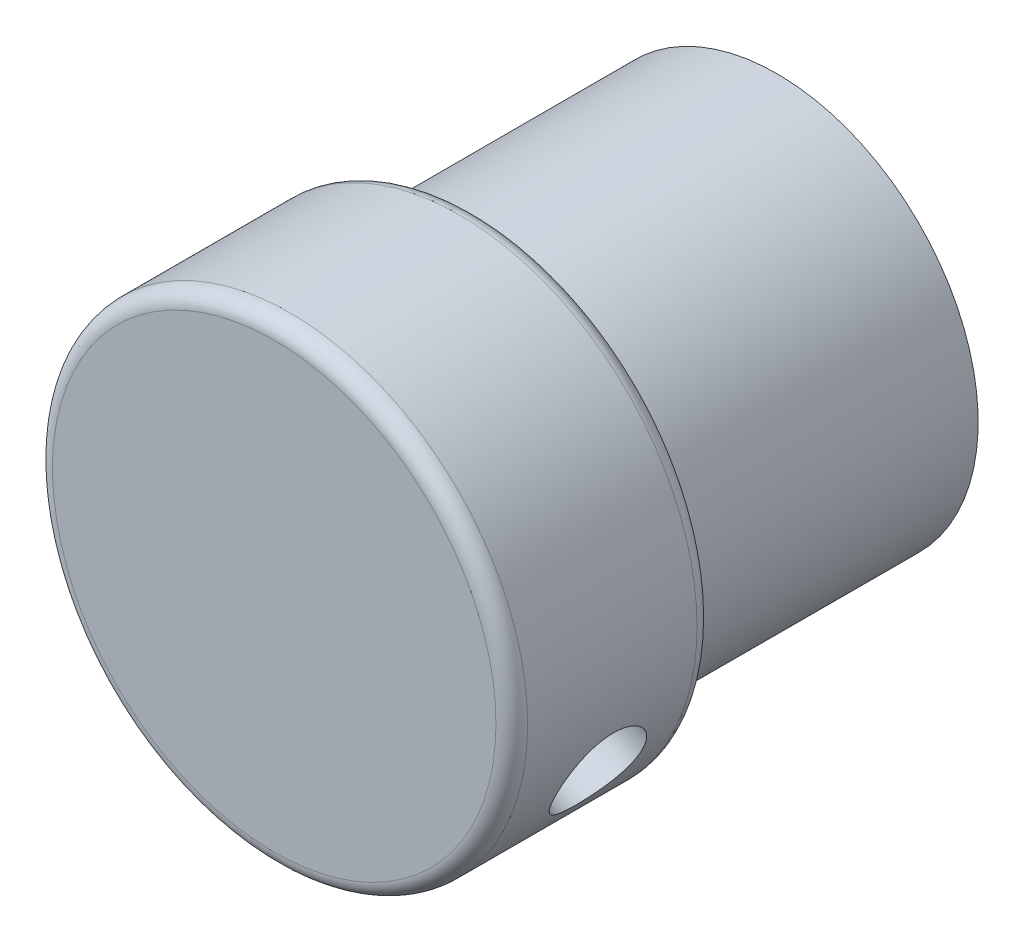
ISO-10303-21;
HEADER;
FILE_DESCRIPTION(('STEP AP214'),'2;1');
FILE_NAME('part.step','',(''),(''),'','','');
FILE_SCHEMA(('AUTOMOTIVE_DESIGN { 1 0 10303 214 1 1 1 1 }'));
ENDSEC;
DATA;
#1=APPLICATION_CONTEXT('core data for automotive mechanical design processes');
#2=APPLICATION_PROTOCOL_DEFINITION('international standard','automotive_design',2000,#1);
#3=PRODUCT_CONTEXT('',#1,'mechanical');
#4=PRODUCT('Part','Part','',(#3));
#5=PRODUCT_RELATED_PRODUCT_CATEGORY('part','',(#4));
#6=PRODUCT_DEFINITION_FORMATION('','',#4);
#7=PRODUCT_DEFINITION_CONTEXT('part definition',#1,'design');
#8=PRODUCT_DEFINITION('design','',#6,#7);
#9=PRODUCT_DEFINITION_SHAPE('','',#8);
#10=(LENGTH_UNIT() NAMED_UNIT(*) SI_UNIT(.MILLI.,.METRE.));
#11=(NAMED_UNIT(*) PLANE_ANGLE_UNIT() SI_UNIT($,.RADIAN.));
#12=(NAMED_UNIT(*) SI_UNIT($,.STERADIAN.) SOLID_ANGLE_UNIT());
#13=UNCERTAINTY_MEASURE_WITH_UNIT(LENGTH_MEASURE(1.E-05),#10,'distance_accuracy_value','');
#14=(GEOMETRIC_REPRESENTATION_CONTEXT(3) GLOBAL_UNCERTAINTY_ASSIGNED_CONTEXT((#13)) GLOBAL_UNIT_ASSIGNED_CONTEXT((#10,
#11,#12)) REPRESENTATION_CONTEXT('',''));
#15=CARTESIAN_POINT('',(0.,0.,0.));
#16=DIRECTION('',(0.,0.,1.));
#17=DIRECTION('',(1.,0.,0.));
#18=AXIS2_PLACEMENT_3D('',#15,#16,#17);
#19=CARTESIAN_POINT('',(102.391841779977,82.5092726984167,19.05));
#20=DIRECTION('',(0.,0.,-1.));
#21=DIRECTION('',(-1.,0.,0.));
#22=AXIS2_PLACEMENT_3D('',#19,#20,#21);
#23=CYLINDRICAL_SURFACE('',#22,12.7);
#24=CARTESIAN_POINT('',(102.391841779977,82.5092726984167,18.05));
#25=DIRECTION('',(0.,0.,1.));
#26=DIRECTION('',(1.,0.,0.));
#27=AXIS2_PLACEMENT_3D('',#24,#25,#26);
#28=CIRCLE('',#27,12.7);
#29=CARTESIAN_POINT('',(89.6918417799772,82.5092726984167,18.05));
#30=VERTEX_POINT('',#29);
#31=EDGE_CURVE('E41',#30,#30,#28,.F.);
#32=CARTESIAN_POINT('',(102.391841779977,82.5092726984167,0.));
#33=DIRECTION('',(0.,0.,1.));
#34=DIRECTION('',(1.,0.,0.));
#35=AXIS2_PLACEMENT_3D('',#32,#33,#34);
#36=CIRCLE('',#35,12.7);
#37=CARTESIAN_POINT('',(89.6918417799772,82.5092726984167,0.));
#38=VERTEX_POINT('',#37);
#39=EDGE_CURVE('E57',#38,#38,#36,.T.);
#40=CARTESIAN_POINT('',(89.6918417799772,82.5092726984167,18.05));
#41=CARTESIAN_POINT('',(89.6918417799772,82.5092726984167,17.8619791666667));
#42=CARTESIAN_POINT('',(89.6918417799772,82.5092726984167,17.6739583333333));
#43=CARTESIAN_POINT('',(89.6918417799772,82.5092726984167,17.2979166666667));
#44=CARTESIAN_POINT('',(89.6918417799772,82.5092726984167,17.1098958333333));
#45=CARTESIAN_POINT('',(89.6918417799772,82.5092726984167,16.7338541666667));
#46=CARTESIAN_POINT('',(89.6918417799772,82.5092726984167,16.5458333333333));
#47=CARTESIAN_POINT('',(89.6918417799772,82.5092726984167,16.1697916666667));
#48=CARTESIAN_POINT('',(89.6918417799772,82.5092726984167,15.9817708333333));
#49=CARTESIAN_POINT('',(89.6918417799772,82.5092726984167,15.6057291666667));
#50=CARTESIAN_POINT('',(89.6918417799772,82.5092726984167,15.4177083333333));
#51=CARTESIAN_POINT('',(89.6918417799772,82.5092726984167,15.0416666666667));
#52=CARTESIAN_POINT('',(89.6918417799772,82.5092726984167,14.8536458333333));
#53=CARTESIAN_POINT('',(89.6918417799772,82.5092726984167,14.4776041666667));
#54=CARTESIAN_POINT('',(89.6918417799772,82.5092726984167,14.2895833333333));
#55=CARTESIAN_POINT('',(89.6918417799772,82.5092726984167,13.9135416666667));
#56=CARTESIAN_POINT('',(89.6918417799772,82.5092726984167,13.7255208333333));
#57=CARTESIAN_POINT('',(89.6918417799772,82.5092726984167,13.3494791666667));
#58=CARTESIAN_POINT('',(89.6918417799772,82.5092726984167,13.1614583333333));
#59=CARTESIAN_POINT('',(89.6918417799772,82.5092726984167,12.7854166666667));
#60=CARTESIAN_POINT('',(89.6918417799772,82.5092726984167,12.5973958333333));
#61=CARTESIAN_POINT('',(89.6918417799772,82.5092726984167,12.2213541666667));
#62=CARTESIAN_POINT('',(89.6918417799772,82.5092726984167,12.0333333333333));
#63=CARTESIAN_POINT('',(89.6918417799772,82.5092726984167,11.6572916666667));
#64=CARTESIAN_POINT('',(89.6918417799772,82.5092726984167,11.4692708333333));
#65=CARTESIAN_POINT('',(89.6918417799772,82.5092726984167,11.0932291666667));
#66=CARTESIAN_POINT('',(89.6918417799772,82.5092726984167,10.9052083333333));
#67=CARTESIAN_POINT('',(89.6918417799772,82.5092726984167,10.5291666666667));
#68=CARTESIAN_POINT('',(89.6918417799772,82.5092726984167,10.3411458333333));
#69=CARTESIAN_POINT('',(89.6918417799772,82.5092726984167,9.96510416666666));
#70=CARTESIAN_POINT('',(89.6918417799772,82.5092726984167,9.77708333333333));
#71=CARTESIAN_POINT('',(89.6918417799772,82.5092726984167,9.40104166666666));
#72=CARTESIAN_POINT('',(89.6918417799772,82.5092726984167,9.21302083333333));
#73=CARTESIAN_POINT('',(89.6918417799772,82.5092726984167,8.83697916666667));
#74=CARTESIAN_POINT('',(89.6918417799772,82.5092726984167,8.64895833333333));
#75=CARTESIAN_POINT('',(89.6918417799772,82.5092726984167,8.27291666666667));
#76=CARTESIAN_POINT('',(89.6918417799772,82.5092726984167,8.08489583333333));
#77=CARTESIAN_POINT('',(89.6918417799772,82.5092726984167,7.70885416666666));
#78=CARTESIAN_POINT('',(89.6918417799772,82.5092726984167,7.52083333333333));
#79=CARTESIAN_POINT('',(89.6918417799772,82.5092726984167,7.14479166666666));
#80=CARTESIAN_POINT('',(89.6918417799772,82.5092726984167,6.95677083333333));
#81=CARTESIAN_POINT('',(89.6918417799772,82.5092726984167,6.58072916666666));
#82=CARTESIAN_POINT('',(89.6918417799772,82.5092726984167,6.39270833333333));
#83=CARTESIAN_POINT('',(89.6918417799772,82.5092726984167,6.01666666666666));
#84=CARTESIAN_POINT('',(89.6918417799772,82.5092726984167,5.82864583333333));
#85=CARTESIAN_POINT('',(89.6918417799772,82.5092726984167,5.45260416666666));
#86=CARTESIAN_POINT('',(89.6918417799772,82.5092726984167,5.26458333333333));
#87=CARTESIAN_POINT('',(89.6918417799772,82.5092726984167,4.88854166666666));
#88=CARTESIAN_POINT('',(89.6918417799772,82.5092726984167,4.70052083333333));
#89=CARTESIAN_POINT('',(89.6918417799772,82.5092726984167,4.32447916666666));
#90=CARTESIAN_POINT('',(89.6918417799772,82.5092726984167,4.13645833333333));
#91=CARTESIAN_POINT('',(89.6918417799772,82.5092726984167,3.76041666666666));
#92=CARTESIAN_POINT('',(89.6918417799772,82.5092726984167,3.57239583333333));
#93=CARTESIAN_POINT('',(89.6918417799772,82.5092726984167,3.19635416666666));
#94=CARTESIAN_POINT('',(89.6918417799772,82.5092726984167,3.00833333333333));
#95=CARTESIAN_POINT('',(89.6918417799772,82.5092726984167,2.63229166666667));
#96=CARTESIAN_POINT('',(89.6918417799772,82.5092726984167,2.44427083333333));
#97=CARTESIAN_POINT('',(89.6918417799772,82.5092726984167,2.06822916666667));
#98=CARTESIAN_POINT('',(89.6918417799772,82.5092726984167,1.88020833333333));
#99=CARTESIAN_POINT('',(89.6918417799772,82.5092726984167,1.50416666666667));
#100=CARTESIAN_POINT('',(89.6918417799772,82.5092726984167,1.31614583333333));
#101=CARTESIAN_POINT('',(89.6918417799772,82.5092726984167,0.940104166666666));
#102=CARTESIAN_POINT('',(89.6918417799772,82.5092726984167,0.752083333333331));
#103=CARTESIAN_POINT('',(89.6918417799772,82.5092726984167,0.376041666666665));
#104=CARTESIAN_POINT('',(89.6918417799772,82.5092726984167,0.188020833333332));
#105=CARTESIAN_POINT('',(89.6918417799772,82.5092726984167,0.));
#106=B_SPLINE_CURVE_WITH_KNOTS('',3,(#40,#41,#42,#43,#44,#45,#46,#47,#48,#49,#50,#51,#52,#53,
#54,#55,#56,#57,#58,#59,#60,#61,#62,#63,#64,#65,#66,#67,#68,#69,#70,#71,#72,#73,#74,#75,#76,#77,
#78,#79,#80,#81,#82,#83,#84,#85,#86,#87,#88,#89,#90,#91,#92,#93,#94,#95,#96,#97,#98,#99,#100,
#101,#102,#103,#104,#105),.UNSPECIFIED.,.F.,.F.,(4,2,2,2,2,2,2,2,2,2,2,2,2,2,2,2,2,2,2,2,2,2,2,
2,2,2,2,2,2,2,2,2,4),(0.,0.5640625,1.128125,1.6921875,2.25625,2.8203125,3.384375,3.9484375,
4.5125,5.0765625,5.640625,6.2046875,6.76875,7.3328125,7.896875,8.4609375,9.025,9.5890625,
10.153125,10.7171875,11.28125,11.8453125,12.409375,12.9734375,13.5375,14.1015625,14.665625,
15.2296875,15.79375,16.3578125,16.921875,17.4859375,18.05),.UNSPECIFIED.);
#107=EDGE_CURVE('BSEAM30',#30,#38,#106,.T.);
#108=ORIENTED_EDGE('',*,*,#31,.T.);
#109=ORIENTED_EDGE('',*,*,#39,.T.);
#110=ORIENTED_EDGE('',*,*,#107,.T.);
#111=ORIENTED_EDGE('',*,*,#107,.F.);
#112=EDGE_LOOP('',(#108,#110,#109,#111));
#113=FACE_BOUND('',#112,.T.);
#114=ADVANCED_FACE('F30',(#113),#23,.T.);
#115=CARTESIAN_POINT('',(102.391841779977,82.5092726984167,0.));
#116=DIRECTION('',(0.,0.,1.));
#117=DIRECTION('',(1.,0.,0.));
#118=AXIS2_PLACEMENT_3D('',#115,#116,#117);
#119=PLANE('',#118);
#120=CARTESIAN_POINT('',(102.391841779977,82.5092726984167,0.));
#121=DIRECTION('',(0.,0.,-1.));
#122=DIRECTION('',(-1.,0.,0.));
#123=AXIS2_PLACEMENT_3D('',#120,#121,#122);
#124=CIRCLE('',#123,2.55270000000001);
#125=CARTESIAN_POINT('',(99.8391417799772,82.5092726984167,0.));
#126=VERTEX_POINT('',#125);
#127=EDGE_CURVE('E54',#126,#126,#124,.T.);
#128=ORIENTED_EDGE('',*,*,#127,.F.);
#129=EDGE_LOOP('',(#128));
#130=FACE_BOUND('',#129,.T.);
#131=ORIENTED_EDGE('',*,*,#39,.F.);
#132=EDGE_LOOP('',(#131));
#133=FACE_BOUND('',#132,.T.);
#134=ADVANCED_FACE('F106',(#130,#133),#119,.F.);
#135=CARTESIAN_POINT('',(102.391841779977,82.5092726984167,19.05));
#136=DIRECTION('',(0.,0.,1.));
#137=DIRECTION('',(1.,0.,0.));
#138=AXIS2_PLACEMENT_3D('',#135,#136,#137);
#139=PLANE('',#138);
#140=CARTESIAN_POINT('',(102.391841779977,82.5092726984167,19.05));
#141=DIRECTION('',(0.,0.,1.));
#142=DIRECTION('',(1.,0.,0.));
#143=AXIS2_PLACEMENT_3D('',#140,#141,#142);
#144=CIRCLE('',#143,14.);
#145=CARTESIAN_POINT('',(116.391841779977,82.5092726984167,19.05));
#146=VERTEX_POINT('',#145);
#147=EDGE_CURVE('E75',#146,#146,#144,.F.);
#148=ORIENTED_EDGE('',*,*,#147,.T.);
#149=EDGE_LOOP('',(#148));
#150=FACE_BOUND('',#149,.T.);
#151=CARTESIAN_POINT('',(102.391841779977,82.5092726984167,19.05));
#152=DIRECTION('',(0.,0.,1.));
#153=DIRECTION('',(1.,0.,0.));
#154=AXIS2_PLACEMENT_3D('',#151,#152,#153);
#155=CIRCLE('',#154,13.7);
#156=CARTESIAN_POINT('',(116.091841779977,82.5092726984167,19.05));
#157=VERTEX_POINT('',#156);
#158=EDGE_CURVE('E72',#157,#157,#155,.T.);
#159=ORIENTED_EDGE('',*,*,#158,.T.);
#160=EDGE_LOOP('',(#159));
#161=FACE_BOUND('',#160,.T.);
#162=ADVANCED_FACE('F104',(#150,#161),#139,.F.);
#163=CARTESIAN_POINT('',(102.391841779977,82.5092726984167,31.75));
#164=DIRECTION('',(0.,0.,-1.));
#165=DIRECTION('',(-1.,0.,0.));
#166=AXIS2_PLACEMENT_3D('',#163,#164,#165);
#167=CYLINDRICAL_SURFACE('',#166,15.);
#168=CARTESIAN_POINT('',(90.2263339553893,91.2842609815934,24.879809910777));
#169=CARTESIAN_POINT('',(90.226328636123,91.2842568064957,25.0376152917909));
#170=CARTESIAN_POINT('',(90.2184454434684,91.2733562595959,25.1954985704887));
#171=CARTESIAN_POINT('',(90.1873378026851,91.2299818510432,25.5068113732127));
#172=CARTESIAN_POINT('',(90.1641004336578,91.1974898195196,25.6602370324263));
#173=CARTESIAN_POINT('',(90.1035971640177,91.111701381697,25.9580851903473));
#174=CARTESIAN_POINT('',(90.0663444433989,91.058424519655,26.1025159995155));
#175=CARTESIAN_POINT('',(89.9797662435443,90.9322300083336,26.3785804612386));
#176=CARTESIAN_POINT('',(89.9304416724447,90.8593138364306,26.51021507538));
#177=CARTESIAN_POINT('',(89.8215192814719,90.6944323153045,26.7586262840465));
#178=CARTESIAN_POINT('',(89.7618112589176,90.6022602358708,26.8752173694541));
#179=CARTESIAN_POINT('',(89.6353064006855,90.4013491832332,27.0886152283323));
#180=CARTESIAN_POINT('',(89.5685090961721,90.292609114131,27.1854206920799));
#181=CARTESIAN_POINT('',(89.4302142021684,90.0600754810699,27.3572113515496));
#182=CARTESIAN_POINT('',(89.3586841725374,89.936171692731,27.4320214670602));
#183=CARTESIAN_POINT('',(89.2143777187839,89.6770066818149,27.5565696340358));
#184=CARTESIAN_POINT('',(89.141601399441,89.5417464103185,27.6063097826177));
#185=CARTESIAN_POINT('',(88.9984529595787,89.2650920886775,27.6787319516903));
#186=CARTESIAN_POINT('',(88.9280625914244,89.1237894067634,27.7017267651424));
#187=CARTESIAN_POINT('',(88.7911699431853,88.8375335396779,27.7209803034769));
#188=CARTESIAN_POINT('',(88.7246673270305,88.692580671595,27.7172413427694));
#189=CARTESIAN_POINT('',(88.5982478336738,88.4051287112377,27.6833730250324));
#190=CARTESIAN_POINT('',(88.5382578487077,88.2626218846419,27.6535804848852));
#191=CARTESIAN_POINT('',(88.4251702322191,87.9823826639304,27.5689836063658));
#192=CARTESIAN_POINT('',(88.3720728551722,87.8446504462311,27.5141783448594));
#193=CARTESIAN_POINT('',(88.2732136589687,87.5772892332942,27.3807919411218));
#194=CARTESIAN_POINT('',(88.2274955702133,87.4477111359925,27.3020764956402));
#195=CARTESIAN_POINT('',(88.1440131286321,87.2014271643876,27.1232031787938));
#196=CARTESIAN_POINT('',(88.1062495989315,87.0847226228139,27.0230430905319));
#197=CARTESIAN_POINT('',(88.0380445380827,86.8660888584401,26.8022686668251));
#198=CARTESIAN_POINT('',(88.0077264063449,86.7644185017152,26.6813596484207));
#199=CARTESIAN_POINT('',(87.9548520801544,86.5814255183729,26.423500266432));
#200=CARTESIAN_POINT('',(87.9322960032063,86.500103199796,26.2865496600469));
#201=CARTESIAN_POINT('',(87.8944941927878,86.3605290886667,26.0001104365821));
#202=CARTESIAN_POINT('',(87.8792613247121,86.3023179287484,25.8506002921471));
#203=CARTESIAN_POINT('',(87.8557905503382,86.2113590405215,25.5435054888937));
#204=CARTESIAN_POINT('',(87.8475518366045,86.1786083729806,25.3859217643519));
#205=CARTESIAN_POINT('',(87.8379031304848,86.1401488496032,25.0697405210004));
#206=CARTESIAN_POINT('',(87.8363904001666,86.1340331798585,24.9111955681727));
#207=CARTESIAN_POINT('',(87.8398681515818,86.1479693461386,24.5953386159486));
#208=CARTESIAN_POINT('',(87.8448583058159,86.1680198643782,24.4380265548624));
#209=CARTESIAN_POINT('',(87.8614165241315,86.2332284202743,24.1304600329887));
#210=CARTESIAN_POINT('',(87.8729288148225,86.2781735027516,23.9801572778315));
#211=CARTESIAN_POINT('',(87.9027867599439,86.3913713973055,23.6893278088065));
#212=CARTESIAN_POINT('',(87.921132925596,86.459625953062,23.5488018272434));
#213=CARTESIAN_POINT('',(87.9653004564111,86.6180094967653,23.2797003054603));
#214=CARTESIAN_POINT('',(87.9912069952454,86.7083857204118,23.1512843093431));
#215=CARTESIAN_POINT('',(88.0507935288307,86.9075811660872,22.9117115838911));
#216=CARTESIAN_POINT('',(88.0844742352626,87.0164020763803,22.8005564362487));
#217=CARTESIAN_POINT('',(88.160368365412,87.2506328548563,22.5971176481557));
#218=CARTESIAN_POINT('',(88.2026916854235,87.376248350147,22.505111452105));
#219=CARTESIAN_POINT('',(88.2955274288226,87.6389215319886,22.3445416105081));
#220=CARTESIAN_POINT('',(88.3460395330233,87.775978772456,22.2759770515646));
#221=CARTESIAN_POINT('',(88.4544585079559,88.0565080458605,22.1646507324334));
#222=CARTESIAN_POINT('',(88.5123245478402,88.1999420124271,22.1217534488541));
#223=CARTESIAN_POINT('',(88.6345968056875,88.4894805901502,22.0625472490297));
#224=CARTESIAN_POINT('',(88.6990023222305,88.6355849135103,22.0462354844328));
#225=CARTESIAN_POINT('',(88.8316521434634,88.9237902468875,22.0407639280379));
#226=CARTESIAN_POINT('',(88.8998210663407,89.0659181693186,22.0511853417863));
#227=CARTESIAN_POINT('',(89.0387920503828,89.3444976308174,22.0979661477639));
#228=CARTESIAN_POINT('',(89.1095940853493,89.4809492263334,22.1343252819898));
#229=CARTESIAN_POINT('',(89.2512106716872,89.7443366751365,22.2317717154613));
#230=CARTESIAN_POINT('',(89.3220249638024,89.8712894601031,22.2928137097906));
#231=CARTESIAN_POINT('',(89.4610879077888,90.1128940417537,22.437842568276));
#232=CARTESIAN_POINT('',(89.529336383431,90.2275449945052,22.5218310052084));
#233=CARTESIAN_POINT('',(89.6614226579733,90.4435471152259,22.7118065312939));
#234=CARTESIAN_POINT('',(89.7251818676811,90.5446805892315,22.8180958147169));
#235=CARTESIAN_POINT('',(89.8443187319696,90.7294785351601,23.0490295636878));
#236=CARTESIAN_POINT('',(89.899694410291,90.8131388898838,23.1736783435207));
#237=CARTESIAN_POINT('',(89.9998494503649,90.9618856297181,23.4392009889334));
#238=CARTESIAN_POINT('',(90.0445238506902,91.0267892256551,23.58021690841));
#239=CARTESIAN_POINT('',(90.1202026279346,91.1354708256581,23.8735026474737));
#240=CARTESIAN_POINT('',(90.1512198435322,91.1792686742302,24.0257617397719));
#241=CARTESIAN_POINT('',(90.1916436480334,91.2360135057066,24.295349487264));
#242=CARTESIAN_POINT('',(90.2046139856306,91.2540826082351,24.4111047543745));
#243=CARTESIAN_POINT('',(90.2219610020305,91.2782077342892,24.6444955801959));
#244=CARTESIAN_POINT('',(90.2263379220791,91.2842640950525,24.7621310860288));
#245=CARTESIAN_POINT('',(90.2263339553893,91.2842609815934,24.879809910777));
#246=B_SPLINE_CURVE_WITH_KNOTS('',3,(#168,#169,#170,#171,#172,#173,#174,#175,#176,#177,#178,
#179,#180,#181,#182,#183,#184,#185,#186,#187,#188,#189,#190,#191,#192,#193,#194,#195,#196,#197,
#198,#199,#200,#201,#202,#203,#204,#205,#206,#207,#208,#209,#210,#211,#212,#213,#214,#215,#216,
#217,#218,#219,#220,#221,#222,#223,#224,#225,#226,#227,#228,#229,#230,#231,#232,#233,#234,#235,
#236,#237,#238,#239,#240,#241,#242,#243,#244,#245),.UNSPECIFIED.,.T.,.F.,(4,2,2,2,2,2,2,2,2,2,2,
2,2,2,2,2,2,2,2,2,2,2,2,2,2,2,2,2,2,2,2,2,2,2,2,2,2,2,4),(0.,0.472985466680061,
0.946369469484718,1.41930941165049,1.89221378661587,2.37048332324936,2.84878450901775,
3.33079578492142,3.8127667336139,4.28904236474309,4.76527676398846,5.23544400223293,
5.70562859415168,6.17850463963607,6.65142959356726,7.13173140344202,7.61204048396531,
8.09319031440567,8.57428459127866,9.04800443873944,9.52170042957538,9.99140551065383,
10.4611457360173,10.9363969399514,11.4116916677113,11.8934554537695,12.3752004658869,
12.8543788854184,13.3335059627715,13.8051731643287,14.2768356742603,14.7476363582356,
15.2184693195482,15.696150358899,16.1739438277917,16.6562475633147,17.1380969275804,
17.4908221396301,17.8435374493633),.UNSPECIFIED.);
#247=CARTESIAN_POINT('',(90.2263339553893,91.2842609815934,24.879809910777));
#248=VERTEX_POINT('',#247);
#249=EDGE_CURVE('E33',#248,#248,#246,.T.);
#250=ORIENTED_EDGE('',*,*,#249,.T.);
#251=EDGE_LOOP('',(#250));
#252=FACE_BOUND('',#251,.T.);
#253=CARTESIAN_POINT('',(116.946250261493,78.8803343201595,24.879809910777));
#254=CARTESIAN_POINT('',(116.946250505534,78.8803275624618,24.7220045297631));
#255=CARTESIAN_POINT('',(116.943012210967,78.8672707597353,24.5641212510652));
#256=CARTESIAN_POINT('',(116.929958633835,78.8155152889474,24.2528084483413));
#257=CARTESIAN_POINT('',(116.92013781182,78.7767950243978,24.0993827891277));
#258=CARTESIAN_POINT('',(116.893659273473,78.6752116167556,23.8015346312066));
#259=CARTESIAN_POINT('',(116.877007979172,78.6123711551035,23.6571038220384));
#260=CARTESIAN_POINT('',(116.836495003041,78.4647922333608,23.3810393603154));
#261=CARTESIAN_POINT('',(116.812633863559,78.3800554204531,23.2494047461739));
#262=CARTESIAN_POINT('',(116.75699166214,78.1904401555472,23.0009935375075));
#263=CARTESIAN_POINT('',(116.725123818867,78.0853441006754,22.8844024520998));
#264=CARTESIAN_POINT('',(116.653308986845,77.8590448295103,22.6710045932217));
#265=CARTESIAN_POINT('',(116.613361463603,77.7378405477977,22.574199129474));
#266=CARTESIAN_POINT('',(116.525001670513,77.4821260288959,22.4024084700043));
#267=CARTESIAN_POINT('',(116.476526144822,77.3475198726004,22.3275983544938));
#268=CARTESIAN_POINT('',(116.371704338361,77.0700252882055,22.2030501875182));
#269=CARTESIAN_POINT('',(116.315358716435,76.92713755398,22.1533100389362));
#270=CARTESIAN_POINT('',(116.196430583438,76.6392396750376,22.0808878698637));
#271=CARTESIAN_POINT('',(116.133929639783,76.4942745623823,22.0578930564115));
#272=CARTESIAN_POINT('',(116.003629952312,76.2049581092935,22.0386395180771));
#273=CARTESIAN_POINT('',(115.935831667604,76.0606067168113,22.0423784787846));
#274=CARTESIAN_POINT('',(115.797858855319,75.7785180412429,22.0762467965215));
#275=CARTESIAN_POINT('',(115.72772560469,75.6407199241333,22.1060393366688));
#276=CARTESIAN_POINT('',(115.586657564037,75.3734697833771,22.1906362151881));
#277=CARTESIAN_POINT('',(115.515722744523,75.244018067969,22.2454414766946));
#278=CARTESIAN_POINT('',(115.375308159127,74.9959477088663,22.3788278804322));
#279=CARTESIAN_POINT('',(115.305839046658,74.8773953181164,22.4575433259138));
#280=CARTESIAN_POINT('',(115.171599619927,74.6546737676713,22.6364166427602));
#281=CARTESIAN_POINT('',(115.106829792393,74.5505060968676,22.7365767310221));
#282=CARTESIAN_POINT('',(114.983850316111,74.3572997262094,22.9573511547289));
#283=CARTESIAN_POINT('',(114.925758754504,74.2685223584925,23.0782601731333));
#284=CARTESIAN_POINT('',(114.820108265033,74.1100291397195,23.336119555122));
#285=CARTESIAN_POINT('',(114.77254949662,74.0403135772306,23.473070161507));
#286=CARTESIAN_POINT('',(114.69033582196,73.9213563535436,23.7595093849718));
#287=CARTESIAN_POINT('',(114.655703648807,73.872150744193,23.9090195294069));
#288=CARTESIAN_POINT('',(114.601374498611,73.795516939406,24.2161143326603));
#289=CARTESIAN_POINT('',(114.581675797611,73.7680862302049,24.3736980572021));
#290=CARTESIAN_POINT('',(114.558526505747,73.7358939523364,24.6898793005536));
#291=CARTESIAN_POINT('',(114.554831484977,73.730791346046,24.8484242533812));
#292=CARTESIAN_POINT('',(114.563231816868,73.7424423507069,25.1642812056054));
#293=CARTESIAN_POINT('',(114.575326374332,73.7591948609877,25.3215932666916));
#294=CARTESIAN_POINT('',(114.614447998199,73.8139290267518,25.6291597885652));
#295=CARTESIAN_POINT('',(114.641348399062,73.8517306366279,25.7794625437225));
#296=CARTESIAN_POINT('',(114.708542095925,73.9475965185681,26.0702920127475));
#297=CARTESIAN_POINT('',(114.748836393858,74.005662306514,26.2108179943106));
#298=CARTESIAN_POINT('',(114.841308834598,74.1416217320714,26.4799195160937));
#299=CARTESIAN_POINT('',(114.893620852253,74.2197399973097,26.6083355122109));
#300=CARTESIAN_POINT('',(115.007315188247,74.3938175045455,26.8479082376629));
#301=CARTESIAN_POINT('',(115.068698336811,74.4897783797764,26.9590633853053));
#302=CARTESIAN_POINT('',(115.198628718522,74.6989244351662,27.1625021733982));
#303=CARTESIAN_POINT('',(115.267262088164,74.812326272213,27.2545083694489));
#304=CARTESIAN_POINT('',(115.40798340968,75.0527699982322,27.4150782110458));
#305=CARTESIAN_POINT('',(115.480071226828,75.1798113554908,27.4836427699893));
#306=CARTESIAN_POINT('',(115.624374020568,75.4436826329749,27.5949690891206));
#307=CARTESIAN_POINT('',(115.696586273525,75.5804567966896,27.6378663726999));
#308=CARTESIAN_POINT('',(115.838829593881,75.8607244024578,27.6970725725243));
#309=CARTESIAN_POINT('',(115.908860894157,76.0042171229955,27.7133843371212));
#310=CARTESIAN_POINT('',(116.043388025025,76.2915509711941,27.718855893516));
#311=CARTESIAN_POINT('',(116.107953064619,76.4353518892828,27.7084344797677));
#312=CARTESIAN_POINT('',(116.231047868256,76.7213013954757,27.66165367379));
#313=CARTESIAN_POINT('',(116.289577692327,76.8634500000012,27.6252945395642));
#314=CARTESIAN_POINT('',(116.399360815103,77.1416151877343,27.5278481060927));
#315=CARTESIAN_POINT('',(116.450627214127,77.2776425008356,27.4668061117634));
#316=CARTESIAN_POINT('',(116.54541999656,77.539798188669,27.321777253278));
#317=CARTESIAN_POINT('',(116.588945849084,77.6659258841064,27.2377888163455));
#318=CARTESIAN_POINT('',(116.668685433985,77.906228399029,27.04781329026));
#319=CARTESIAN_POINT('',(116.704783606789,78.0202026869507,26.9415240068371));
#320=CARTESIAN_POINT('',(116.769046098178,78.2304744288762,26.7105902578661));
#321=CARTESIAN_POINT('',(116.79720854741,78.326767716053,26.5859414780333));
#322=CARTESIAN_POINT('',(116.846185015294,78.4992725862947,26.3204188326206));
#323=CARTESIAN_POINT('',(116.866927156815,78.5752860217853,26.179402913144));
#324=CARTESIAN_POINT('',(116.901097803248,78.7032365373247,25.8861171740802));
#325=CARTESIAN_POINT('',(116.91453317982,78.7551962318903,25.733858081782));
#326=CARTESIAN_POINT('',(116.931786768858,78.8226971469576,25.46427033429));
#327=CARTESIAN_POINT('',(116.937217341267,78.8442663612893,25.3485150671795));
#328=CARTESIAN_POINT('',(116.944448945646,78.8730872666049,25.1151242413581));
#329=CARTESIAN_POINT('',(116.946250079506,78.8803393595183,24.9974887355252));
#330=CARTESIAN_POINT('',(116.946250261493,78.8803343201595,24.879809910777));
#331=B_SPLINE_CURVE_WITH_KNOTS('',3,(#253,#254,#255,#256,#257,#258,#259,#260,#261,#262,#263,
#264,#265,#266,#267,#268,#269,#270,#271,#272,#273,#274,#275,#276,#277,#278,#279,#280,#281,#282,
#283,#284,#285,#286,#287,#288,#289,#290,#291,#292,#293,#294,#295,#296,#297,#298,#299,#300,#301,
#302,#303,#304,#305,#306,#307,#308,#309,#310,#311,#312,#313,#314,#315,#316,#317,#318,#319,#320,
#321,#322,#323,#324,#325,#326,#327,#328,#329,#330),.UNSPECIFIED.,.T.,.F.,(4,2,2,2,2,2,2,2,2,2,2,
2,2,2,2,2,2,2,2,2,2,2,2,2,2,2,2,2,2,2,2,2,2,2,2,2,2,2,4),(0.,0.472985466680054,
0.946369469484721,1.41930941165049,1.89221378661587,2.37048332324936,2.84878450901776,
3.33079578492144,3.81276673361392,4.28904236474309,4.76527676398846,5.23544400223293,
5.70562859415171,6.17850463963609,6.65142959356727,7.13173140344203,7.61204048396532,
8.09319031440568,8.57428459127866,9.04800443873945,9.52170042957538,9.99140551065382,
10.4611457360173,10.9363969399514,11.4116916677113,11.8934554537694,12.3752004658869,
12.8543788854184,13.3335059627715,13.8051731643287,14.2768356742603,14.7476363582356,
15.2184693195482,15.6961503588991,16.1739438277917,16.6562475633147,17.1380969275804,
17.4908221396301,17.8435374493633),.UNSPECIFIED.);
#332=CARTESIAN_POINT('',(116.946250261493,78.8803343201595,24.879809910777));
#333=VERTEX_POINT('',#332);
#334=EDGE_CURVE('E11',#333,#333,#331,.T.);
#335=ORIENTED_EDGE('',*,*,#334,.T.);
#336=EDGE_LOOP('',(#335));
#337=FACE_BOUND('',#336,.T.);
#338=CARTESIAN_POINT('',(102.391841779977,82.5092726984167,30.75));
#339=DIRECTION('',(0.,0.,1.));
#340=DIRECTION('',(1.,0.,0.));
#341=AXIS2_PLACEMENT_3D('',#338,#339,#340);
#342=CIRCLE('',#341,15.);
#343=CARTESIAN_POINT('',(117.391841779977,82.5092726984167,30.75));
#344=VERTEX_POINT('',#343);
#345=EDGE_CURVE('E69',#344,#344,#342,.F.);
#346=ORIENTED_EDGE('',*,*,#345,.T.);
#347=EDGE_LOOP('',(#346));
#348=FACE_BOUND('',#347,.T.);
#349=CARTESIAN_POINT('',(102.391841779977,82.5092726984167,20.05));
#350=DIRECTION('',(0.,0.,1.));
#351=DIRECTION('',(1.,0.,0.));
#352=AXIS2_PLACEMENT_3D('',#349,#350,#351);
#353=CIRCLE('',#352,15.);
#354=CARTESIAN_POINT('',(117.391841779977,82.5092726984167,20.05));
#355=VERTEX_POINT('',#354);
#356=EDGE_CURVE('E66',#355,#355,#353,.T.);
#357=ORIENTED_EDGE('',*,*,#356,.T.);
#358=EDGE_LOOP('',(#357));
#359=FACE_BOUND('',#358,.T.);
#360=ADVANCED_FACE('F81',(#252,#337,#348,#359),#167,.T.);
#361=CARTESIAN_POINT('',(102.391841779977,82.5092726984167,31.75));
#362=DIRECTION('',(0.,0.,1.));
#363=DIRECTION('',(1.,0.,0.));
#364=AXIS2_PLACEMENT_3D('',#361,#362,#363);
#365=PLANE('',#364);
#366=CARTESIAN_POINT('',(102.391841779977,82.5092726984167,31.75));
#367=DIRECTION('',(0.,0.,1.));
#368=DIRECTION('',(1.,0.,0.));
#369=AXIS2_PLACEMENT_3D('',#366,#367,#368);
#370=CIRCLE('',#369,14.);
#371=CARTESIAN_POINT('',(116.391841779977,82.5092726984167,31.75));
#372=VERTEX_POINT('',#371);
#373=EDGE_CURVE('E63',#372,#372,#370,.T.);
#374=ORIENTED_EDGE('',*,*,#373,.T.);
#375=EDGE_LOOP('',(#374));
#376=FACE_BOUND('',#375,.T.);
#377=ADVANCED_FACE('F103',(#376),#365,.T.);
#378=CARTESIAN_POINT('',(102.391841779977,82.5092726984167,0.));
#379=DIRECTION('',(0.,0.,-1.));
#380=DIRECTION('',(-1.,0.,0.));
#381=AXIS2_PLACEMENT_3D('',#378,#379,#380);
#382=CYLINDRICAL_SURFACE('',#381,2.5527);
#383=CARTESIAN_POINT('',(102.391841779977,82.5092726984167,19.05));
#384=DIRECTION('',(0.,0.,-1.));
#385=DIRECTION('',(-1.,0.,0.));
#386=AXIS2_PLACEMENT_3D('',#383,#384,#385);
#387=CIRCLE('',#386,2.55269999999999);
#388=CARTESIAN_POINT('',(99.8391417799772,82.5092726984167,19.05));
#389=VERTEX_POINT('',#388);
#390=EDGE_CURVE('E52',#389,#389,#387,.T.);
#391=ORIENTED_EDGE('',*,*,#390,.F.);
#392=EDGE_LOOP('',(#391));
#393=FACE_BOUND('',#392,.T.);
#394=ORIENTED_EDGE('',*,*,#127,.T.);
#395=EDGE_LOOP('',(#394));
#396=FACE_BOUND('',#395,.T.);
#397=ADVANCED_FACE('F48',(#393,#396),#382,.F.);
#398=CARTESIAN_POINT('',(102.391841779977,82.5092726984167,19.05));
#399=DIRECTION('',(0.,0.,-1.));
#400=DIRECTION('',(-1.,0.,0.));
#401=AXIS2_PLACEMENT_3D('',#398,#399,#400);
#402=CONICAL_SURFACE('',#401,2.55269999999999,1.02974425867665);
#403=CARTESIAN_POINT('',(102.391841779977,82.5092726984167,20.5838169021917));
#404=VERTEX_POINT('',#403);
#405=VERTEX_LOOP('',#404);
#406=FACE_BOUND('',#405,.T.);
#407=ORIENTED_EDGE('',*,*,#390,.T.);
#408=EDGE_LOOP('',(#407));
#409=FACE_BOUND('',#408,.T.);
#410=ADVANCED_FACE('F44',(#406,#409),#402,.F.);
#411=CARTESIAN_POINT('',(102.391841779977,82.5092726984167,30.75));
#412=DIRECTION('',(0.,0.,1.));
#413=DIRECTION('',(1.,0.,0.));
#414=AXIS2_PLACEMENT_3D('',#411,#412,#413);
#415=TOROIDAL_SURFACE('',#414,14.,1.);
#416=ORIENTED_EDGE('',*,*,#345,.F.);
#417=EDGE_LOOP('',(#416));
#418=FACE_BOUND('',#417,.T.);
#419=ORIENTED_EDGE('',*,*,#373,.F.);
#420=EDGE_LOOP('',(#419));
#421=FACE_BOUND('',#420,.T.);
#422=ADVANCED_FACE('F47',(#418,#421),#415,.T.);
#423=CARTESIAN_POINT('',(102.391841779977,82.5092726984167,20.05));
#424=DIRECTION('',(0.,0.,1.));
#425=DIRECTION('',(1.,0.,0.));
#426=AXIS2_PLACEMENT_3D('',#423,#424,#425);
#427=TOROIDAL_SURFACE('',#426,14.,1.);
#428=ORIENTED_EDGE('',*,*,#147,.F.);
#429=EDGE_LOOP('',(#428));
#430=FACE_BOUND('',#429,.T.);
#431=ORIENTED_EDGE('',*,*,#356,.F.);
#432=EDGE_LOOP('',(#431));
#433=FACE_BOUND('',#432,.T.);
#434=ADVANCED_FACE('F93',(#430,#433),#427,.T.);
#435=CARTESIAN_POINT('',(102.391841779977,82.5092726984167,18.05));
#436=DIRECTION('',(0.,0.,1.));
#437=DIRECTION('',(1.,0.,0.));
#438=AXIS2_PLACEMENT_3D('',#435,#436,#437);
#439=TOROIDAL_SURFACE('',#438,13.7,1.);
#440=ORIENTED_EDGE('',*,*,#31,.F.);
#441=EDGE_LOOP('',(#440));
#442=FACE_BOUND('',#441,.T.);
#443=ORIENTED_EDGE('',*,*,#158,.F.);
#444=EDGE_LOOP('',(#443));
#445=FACE_BOUND('',#444,.T.);
#446=ADVANCED_FACE('F88',(#442,#445),#439,.F.);
#447=CARTESIAN_POINT('',(84.3224910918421,90.8974314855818,24.879809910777));
#448=DIRECTION('',(0.907031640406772,-0.421062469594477,0.));
#449=DIRECTION('',(0.421062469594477,0.907031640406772,0.));
#450=AXIS2_PLACEMENT_3D('',#447,#448,#449);
#451=CYLINDRICAL_SURFACE('',#450,2.83675324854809);
#452=ORIENTED_EDGE('',*,*,#334,.F.);
#453=EDGE_LOOP('',(#452));
#454=FACE_BOUND('',#453,.T.);
#455=ORIENTED_EDGE('',*,*,#249,.F.);
#456=EDGE_LOOP('',(#455));
#457=FACE_BOUND('',#456,.T.);
#458=ADVANCED_FACE('F84',(#454,#457),#451,.F.);
#459=CLOSED_SHELL('',(#114,#134,#162,#360,#377,#397,#410,#422,#434,#446,#458));
#460=MANIFOLD_SOLID_BREP('B2',#459);
#461=ADVANCED_BREP_SHAPE_REPRESENTATION('',(#18,#460),#14);
#462=SHAPE_DEFINITION_REPRESENTATION(#9,#461);
ENDSEC;
END-ISO-10303-21;
